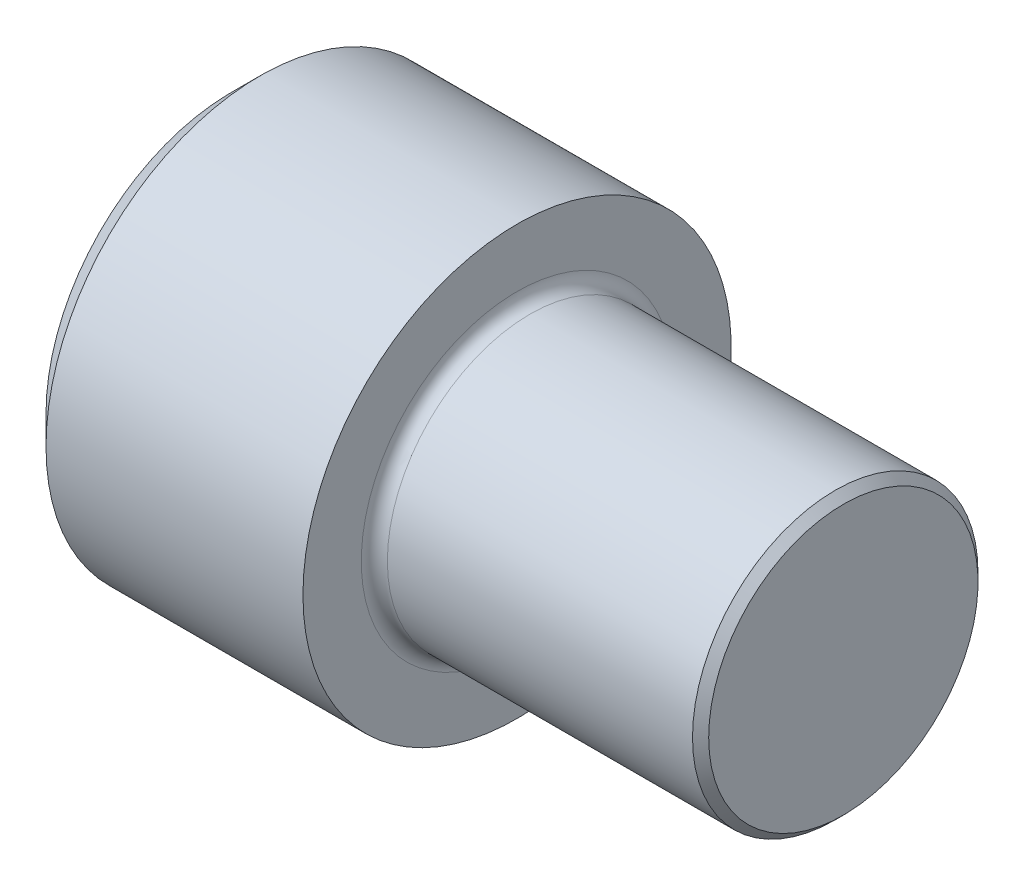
from build123d import *

# Parameters (mm, degrees)
FILLET1_R   = 2.032
HEX_2_DEPTH = 22.098


with BuildPart() as part:
    # BodySke → Base-Revolve (revolve)
    with BuildSketch(Plane.XY, mode=Mode.PRIVATE) as base_revolve_sk:
        Polygon((0, 0), (0, 28.8925), (4.445, 33.3375), (44.45, 33.3375), (44.45, 22.225), (93.99016, 22.225), (95.25, 20.96516), (95.25, 0), align=None)
    revolve(base_revolve_sk.sketch.rotate(Axis((-31.75, 0, 0), (1, 0, 0)), 90), axis=Axis((-31.75, 0, 0), (1, 0, 0)))

    # Fillet1
    fillet1_edges = [part.edges().sort_by_distance(p)[0] for p in [
        (44.45, 0, -22.225),
    ]]
    fillet(fillet1_edges, radius=FILLET1_R)

    # Sketch2 → Hex-PreBroach (revolve, cut)
    with BuildSketch(Plane.XY, mode=Mode.PRIVATE) as hex_prebroach_sk:
        Polygon((0, 15.875), (22.098, 15.875), (31.263435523, 0), (0, 0), align=None)
    revolve(hex_prebroach_sk.sketch.rotate(Axis((0, 0, 0), (1, 0, 0)), 90), axis=Axis((0, 0, 0), (1, 0, 0)), mode=Mode.SUBTRACT)

    # Sketch3 → Hex 2 (cut)
    with BuildSketch(Plane(origin=(0, 0, 0), x_dir=(0, 0.500000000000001, 0.866025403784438), z_dir=(-1, 0, 0))):
        Polygon((9.165435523, 15.875), (-9.165435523, 15.875), (-18.330871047, 0), (-9.165435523, -15.875), (9.165435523, -15.875), (18.330871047, 0), align=None)
    extrude(amount=-HEX_2_DEPTH, mode=Mode.SUBTRACT)


solid = part.part
